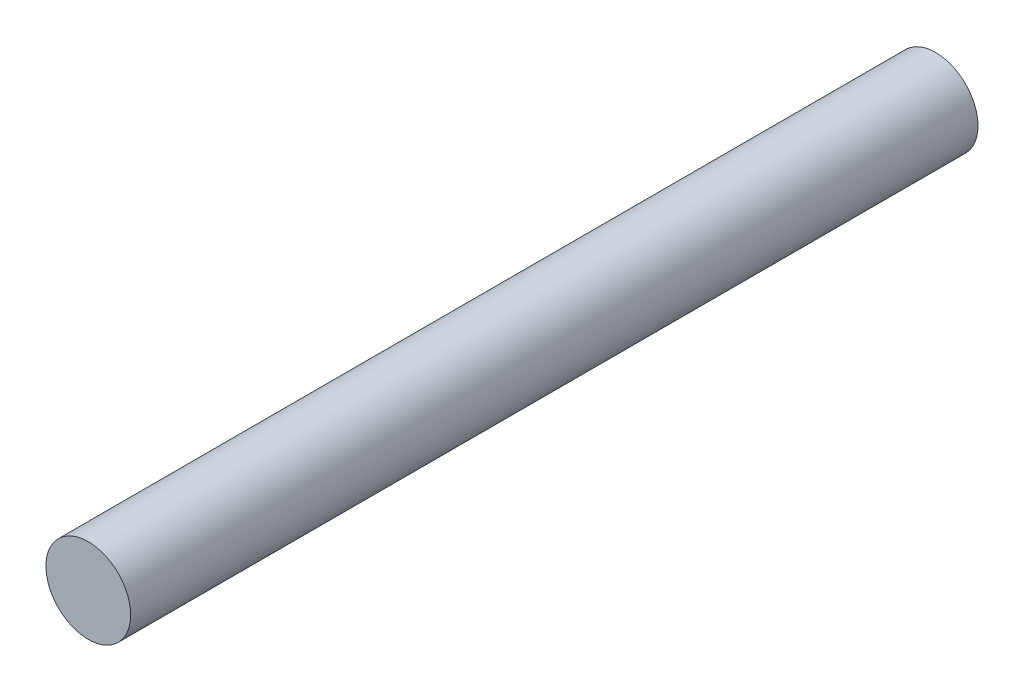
from build123d import *

# Parameters (mm, degrees)
SKETCH_1_R      = 2.5
EXTRUDE_1_DEPTH = 50


with BuildPart() as part:
    # Sketch 1 → Extrude 1 (new body)
    with BuildSketch(Plane.XY):
        with Locations((36.119111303, -58.196758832)):
            Circle(SKETCH_1_R)
    extrude(amount=EXTRUDE_1_DEPTH)


solid = part.part
